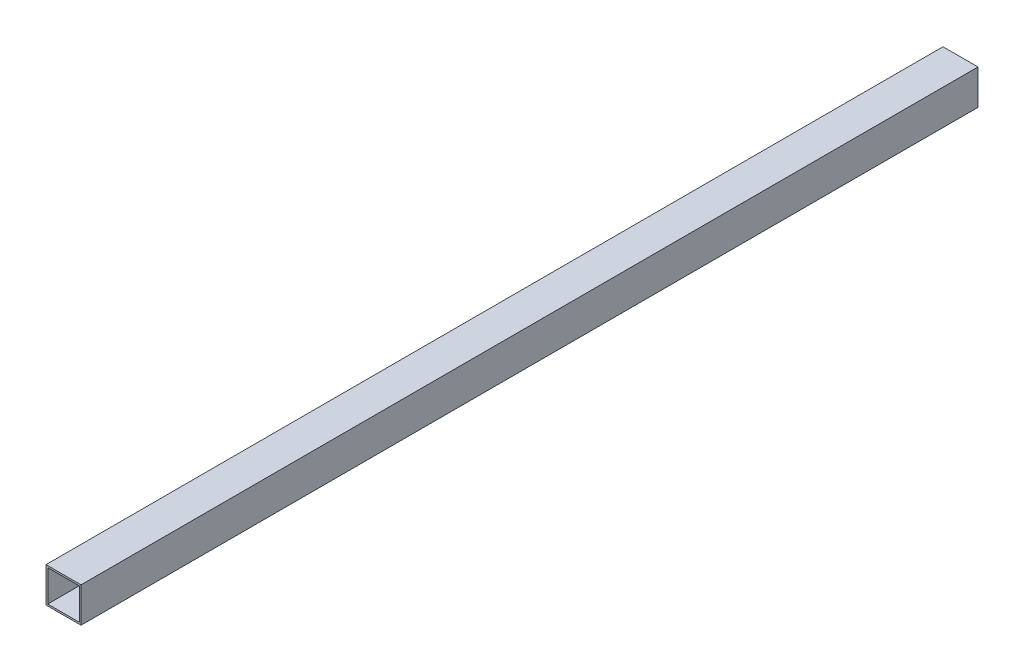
ISO-10303-21;
HEADER;
FILE_DESCRIPTION(('STEP AP214'),'2;1');
FILE_NAME('part.step','',(''),(''),'','','');
FILE_SCHEMA(('AUTOMOTIVE_DESIGN { 1 0 10303 214 1 1 1 1 }'));
ENDSEC;
DATA;
#1=APPLICATION_CONTEXT('core data for automotive mechanical design processes');
#2=APPLICATION_PROTOCOL_DEFINITION('international standard','automotive_design',2000,#1);
#3=PRODUCT_CONTEXT('',#1,'mechanical');
#4=PRODUCT('Part','Part','',(#3));
#5=PRODUCT_RELATED_PRODUCT_CATEGORY('part','',(#4));
#6=PRODUCT_DEFINITION_FORMATION('','',#4);
#7=PRODUCT_DEFINITION_CONTEXT('part definition',#1,'design');
#8=PRODUCT_DEFINITION('design','',#6,#7);
#9=PRODUCT_DEFINITION_SHAPE('','',#8);
#10=(LENGTH_UNIT() NAMED_UNIT(*) SI_UNIT(.MILLI.,.METRE.));
#11=(NAMED_UNIT(*) PLANE_ANGLE_UNIT() SI_UNIT($,.RADIAN.));
#12=(NAMED_UNIT(*) SI_UNIT($,.STERADIAN.) SOLID_ANGLE_UNIT());
#13=UNCERTAINTY_MEASURE_WITH_UNIT(LENGTH_MEASURE(1.E-05),#10,'distance_accuracy_value','');
#14=(GEOMETRIC_REPRESENTATION_CONTEXT(3) GLOBAL_UNCERTAINTY_ASSIGNED_CONTEXT((#13)) GLOBAL_UNIT_ASSIGNED_CONTEXT((#10,
#11,#12)) REPRESENTATION_CONTEXT('',''));
#15=CARTESIAN_POINT('',(0.,0.,0.));
#16=DIRECTION('',(0.,0.,1.));
#17=DIRECTION('',(1.,0.,0.));
#18=AXIS2_PLACEMENT_3D('',#15,#16,#17);
#19=CARTESIAN_POINT('',(0.,0.,2050.));
#20=DIRECTION('',(0.,0.,1.));
#21=DIRECTION('',(1.,0.,0.));
#22=AXIS2_PLACEMENT_3D('',#19,#20,#21);
#23=PLANE('',#22);
#24=DIRECTION('',(0.,-1.,0.));
#25=VECTOR('',#24,1.);
#26=CARTESIAN_POINT('',(-36.,36.,2050.));
#27=LINE('',#26,#25);
#28=CARTESIAN_POINT('',(-36.,36.,2050.));
#29=VERTEX_POINT('',#28);
#30=CARTESIAN_POINT('',(-36.,-36.,2050.));
#31=VERTEX_POINT('',#30);
#32=EDGE_CURVE('E27',#29,#31,#27,.T.);
#33=ORIENTED_EDGE('',*,*,#32,.F.);
#34=DIRECTION('',(-1.,0.,0.));
#35=VECTOR('',#34,1.);
#36=CARTESIAN_POINT('',(36.,36.,2050.));
#37=LINE('',#36,#35);
#38=CARTESIAN_POINT('',(36.,36.,2050.));
#39=VERTEX_POINT('',#38);
#40=EDGE_CURVE('E183',#39,#29,#37,.T.);
#41=ORIENTED_EDGE('',*,*,#40,.F.);
#42=DIRECTION('',(0.,1.,0.));
#43=VECTOR('',#42,1.);
#44=CARTESIAN_POINT('',(36.,-36.,2050.));
#45=LINE('',#44,#43);
#46=CARTESIAN_POINT('',(36.,-36.,2050.));
#47=VERTEX_POINT('',#46);
#48=EDGE_CURVE('E171',#47,#39,#45,.T.);
#49=ORIENTED_EDGE('',*,*,#48,.F.);
#50=DIRECTION('',(1.,0.,0.));
#51=VECTOR('',#50,1.);
#52=CARTESIAN_POINT('',(-36.,-36.,2050.));
#53=LINE('',#52,#51);
#54=EDGE_CURVE('E163',#31,#47,#53,.T.);
#55=ORIENTED_EDGE('',*,*,#54,.F.);
#56=EDGE_LOOP('',(#33,#41,#49,#55));
#57=FACE_BOUND('',#56,.T.);
#58=DIRECTION('',(1.,0.,0.));
#59=VECTOR('',#58,1.);
#60=CARTESIAN_POINT('',(-40.,-40.,2050.));
#61=LINE('',#60,#59);
#62=CARTESIAN_POINT('',(-40.,-40.,2050.));
#63=VERTEX_POINT('',#62);
#64=CARTESIAN_POINT('',(40.,-40.,2050.));
#65=VERTEX_POINT('',#64);
#66=EDGE_CURVE('E118',#63,#65,#61,.T.);
#67=ORIENTED_EDGE('',*,*,#66,.T.);
#68=DIRECTION('',(0.,1.,0.));
#69=VECTOR('',#68,1.);
#70=CARTESIAN_POINT('',(40.,-40.,2050.));
#71=LINE('',#70,#69);
#72=CARTESIAN_POINT('',(40.,40.,2050.));
#73=VERTEX_POINT('',#72);
#74=EDGE_CURVE('E135',#65,#73,#71,.T.);
#75=ORIENTED_EDGE('',*,*,#74,.T.);
#76=DIRECTION('',(-1.,0.,0.));
#77=VECTOR('',#76,1.);
#78=CARTESIAN_POINT('',(40.,40.,2050.));
#79=LINE('',#78,#77);
#80=CARTESIAN_POINT('',(-40.,40.,2050.));
#81=VERTEX_POINT('',#80);
#82=EDGE_CURVE('E110',#73,#81,#79,.T.);
#83=ORIENTED_EDGE('',*,*,#82,.T.);
#84=DIRECTION('',(0.,-1.,0.));
#85=VECTOR('',#84,1.);
#86=CARTESIAN_POINT('',(-40.,40.,2050.));
#87=LINE('',#86,#85);
#88=EDGE_CURVE('E109',#81,#63,#87,.T.);
#89=ORIENTED_EDGE('',*,*,#88,.T.);
#90=EDGE_LOOP('',(#67,#75,#83,#89));
#91=FACE_BOUND('',#90,.T.);
#92=ADVANCED_FACE('F16',(#57,#91),#23,.T.);
#93=CARTESIAN_POINT('',(0.,0.,0.));
#94=DIRECTION('',(0.,0.,1.));
#95=DIRECTION('',(1.,0.,0.));
#96=AXIS2_PLACEMENT_3D('',#93,#94,#95);
#97=PLANE('',#96);
#98=DIRECTION('',(1.,0.,0.));
#99=VECTOR('',#98,1.);
#100=CARTESIAN_POINT('',(-36.,-36.,0.));
#101=LINE('',#100,#99);
#102=CARTESIAN_POINT('',(-36.,-36.,0.));
#103=VERTEX_POINT('',#102);
#104=CARTESIAN_POINT('',(36.,-36.,0.));
#105=VERTEX_POINT('',#104);
#106=EDGE_CURVE('E134',#103,#105,#101,.T.);
#107=ORIENTED_EDGE('',*,*,#106,.T.);
#108=DIRECTION('',(0.,1.,0.));
#109=VECTOR('',#108,1.);
#110=CARTESIAN_POINT('',(36.,-36.,0.));
#111=LINE('',#110,#109);
#112=CARTESIAN_POINT('',(36.,36.,0.));
#113=VERTEX_POINT('',#112);
#114=EDGE_CURVE('E179',#105,#113,#111,.T.);
#115=ORIENTED_EDGE('',*,*,#114,.T.);
#116=DIRECTION('',(-1.,0.,0.));
#117=VECTOR('',#116,1.);
#118=CARTESIAN_POINT('',(36.,36.,0.));
#119=LINE('',#118,#117);
#120=CARTESIAN_POINT('',(-36.,36.,0.));
#121=VERTEX_POINT('',#120);
#122=EDGE_CURVE('E158',#113,#121,#119,.T.);
#123=ORIENTED_EDGE('',*,*,#122,.T.);
#124=DIRECTION('',(0.,-1.,0.));
#125=VECTOR('',#124,1.);
#126=CARTESIAN_POINT('',(-36.,36.,0.));
#127=LINE('',#126,#125);
#128=EDGE_CURVE('E10',#121,#103,#127,.T.);
#129=ORIENTED_EDGE('',*,*,#128,.T.);
#130=EDGE_LOOP('',(#107,#115,#123,#129));
#131=FACE_BOUND('',#130,.T.);
#132=DIRECTION('',(0.,-1.,0.));
#133=VECTOR('',#132,1.);
#134=CARTESIAN_POINT('',(-40.,40.,0.));
#135=LINE('',#134,#133);
#136=CARTESIAN_POINT('',(-40.,40.,0.));
#137=VERTEX_POINT('',#136);
#138=CARTESIAN_POINT('',(-40.,-40.,0.));
#139=VERTEX_POINT('',#138);
#140=EDGE_CURVE('E98',#137,#139,#135,.T.);
#141=ORIENTED_EDGE('',*,*,#140,.F.);
#142=DIRECTION('',(-1.,0.,0.));
#143=VECTOR('',#142,1.);
#144=CARTESIAN_POINT('',(40.,40.,0.));
#145=LINE('',#144,#143);
#146=CARTESIAN_POINT('',(40.,40.,0.));
#147=VERTEX_POINT('',#146);
#148=EDGE_CURVE('E137',#147,#137,#145,.T.);
#149=ORIENTED_EDGE('',*,*,#148,.F.);
#150=DIRECTION('',(0.,1.,0.));
#151=VECTOR('',#150,1.);
#152=CARTESIAN_POINT('',(40.,-40.,0.));
#153=LINE('',#152,#151);
#154=CARTESIAN_POINT('',(40.,-40.,0.));
#155=VERTEX_POINT('',#154);
#156=EDGE_CURVE('E120',#155,#147,#153,.T.);
#157=ORIENTED_EDGE('',*,*,#156,.F.);
#158=DIRECTION('',(1.,0.,0.));
#159=VECTOR('',#158,1.);
#160=CARTESIAN_POINT('',(-40.,-40.,0.));
#161=LINE('',#160,#159);
#162=EDGE_CURVE('E116',#139,#155,#161,.T.);
#163=ORIENTED_EDGE('',*,*,#162,.F.);
#164=EDGE_LOOP('',(#141,#149,#157,#163));
#165=FACE_BOUND('',#164,.T.);
#166=ADVANCED_FACE('F18',(#131,#165),#97,.F.);
#167=CARTESIAN_POINT('',(-36.,36.,0.));
#168=DIRECTION('',(1.,0.,0.));
#169=DIRECTION('',(0.,1.,0.));
#170=AXIS2_PLACEMENT_3D('',#167,#168,#169);
#171=PLANE('',#170);
#172=DIRECTION('',(0.,0.,1.));
#173=VECTOR('',#172,1.);
#174=CARTESIAN_POINT('',(-36.,36.,0.));
#175=LINE('',#174,#173);
#176=EDGE_CURVE('E20',#121,#29,#175,.T.);
#177=ORIENTED_EDGE('',*,*,#176,.T.);
#178=ORIENTED_EDGE('',*,*,#32,.T.);
#179=DIRECTION('',(0.,0.,1.));
#180=VECTOR('',#179,1.);
#181=CARTESIAN_POINT('',(-36.,-36.,0.));
#182=LINE('',#181,#180);
#183=EDGE_CURVE('E156',#103,#31,#182,.T.);
#184=ORIENTED_EDGE('',*,*,#183,.F.);
#185=ORIENTED_EDGE('',*,*,#128,.F.);
#186=EDGE_LOOP('',(#177,#178,#184,#185));
#187=FACE_BOUND('',#186,.T.);
#188=ADVANCED_FACE('F193',(#187),#171,.T.);
#189=CARTESIAN_POINT('',(36.,36.,0.));
#190=DIRECTION('',(0.,-1.,0.));
#191=DIRECTION('',(0.,0.,-1.));
#192=AXIS2_PLACEMENT_3D('',#189,#190,#191);
#193=PLANE('',#192);
#194=DIRECTION('',(0.,0.,1.));
#195=VECTOR('',#194,1.);
#196=CARTESIAN_POINT('',(36.,36.,0.));
#197=LINE('',#196,#195);
#198=EDGE_CURVE('E175',#113,#39,#197,.T.);
#199=ORIENTED_EDGE('',*,*,#198,.T.);
#200=ORIENTED_EDGE('',*,*,#40,.T.);
#201=ORIENTED_EDGE('',*,*,#176,.F.);
#202=ORIENTED_EDGE('',*,*,#122,.F.);
#203=EDGE_LOOP('',(#199,#200,#201,#202));
#204=FACE_BOUND('',#203,.T.);
#205=ADVANCED_FACE('F196',(#204),#193,.T.);
#206=CARTESIAN_POINT('',(36.,-36.,0.));
#207=DIRECTION('',(-1.,0.,0.));
#208=DIRECTION('',(0.,0.,1.));
#209=AXIS2_PLACEMENT_3D('',#206,#207,#208);
#210=PLANE('',#209);
#211=DIRECTION('',(0.,0.,1.));
#212=VECTOR('',#211,1.);
#213=CARTESIAN_POINT('',(36.,-36.,0.));
#214=LINE('',#213,#212);
#215=EDGE_CURVE('E167',#105,#47,#214,.T.);
#216=ORIENTED_EDGE('',*,*,#215,.T.);
#217=ORIENTED_EDGE('',*,*,#48,.T.);
#218=ORIENTED_EDGE('',*,*,#198,.F.);
#219=ORIENTED_EDGE('',*,*,#114,.F.);
#220=EDGE_LOOP('',(#216,#217,#218,#219));
#221=FACE_BOUND('',#220,.T.);
#222=ADVANCED_FACE('F212',(#221),#210,.T.);
#223=CARTESIAN_POINT('',(-36.,-36.,0.));
#224=DIRECTION('',(0.,1.,0.));
#225=DIRECTION('',(1.,0.,0.));
#226=AXIS2_PLACEMENT_3D('',#223,#224,#225);
#227=PLANE('',#226);
#228=ORIENTED_EDGE('',*,*,#183,.T.);
#229=ORIENTED_EDGE('',*,*,#54,.T.);
#230=ORIENTED_EDGE('',*,*,#215,.F.);
#231=ORIENTED_EDGE('',*,*,#106,.F.);
#232=EDGE_LOOP('',(#228,#229,#230,#231));
#233=FACE_BOUND('',#232,.T.);
#234=ADVANCED_FACE('F203',(#233),#227,.T.);
#235=CARTESIAN_POINT('',(-40.,40.,0.));
#236=DIRECTION('',(1.,0.,0.));
#237=DIRECTION('',(0.,1.,0.));
#238=AXIS2_PLACEMENT_3D('',#235,#236,#237);
#239=PLANE('',#238);
#240=ORIENTED_EDGE('',*,*,#140,.T.);
#241=DIRECTION('',(0.,0.,1.));
#242=VECTOR('',#241,1.);
#243=CARTESIAN_POINT('',(-40.,-40.,0.));
#244=LINE('',#243,#242);
#245=EDGE_CURVE('E101',#139,#63,#244,.T.);
#246=ORIENTED_EDGE('',*,*,#245,.T.);
#247=ORIENTED_EDGE('',*,*,#88,.F.);
#248=DIRECTION('',(0.,0.,1.));
#249=VECTOR('',#248,1.);
#250=CARTESIAN_POINT('',(-40.,40.,0.));
#251=LINE('',#250,#249);
#252=EDGE_CURVE('E104',#137,#81,#251,.T.);
#253=ORIENTED_EDGE('',*,*,#252,.F.);
#254=EDGE_LOOP('',(#240,#246,#247,#253));
#255=FACE_BOUND('',#254,.T.);
#256=ADVANCED_FACE('F100',(#255),#239,.F.);
#257=CARTESIAN_POINT('',(40.,40.,0.));
#258=DIRECTION('',(0.,-1.,0.));
#259=DIRECTION('',(0.,0.,-1.));
#260=AXIS2_PLACEMENT_3D('',#257,#258,#259);
#261=PLANE('',#260);
#262=ORIENTED_EDGE('',*,*,#148,.T.);
#263=ORIENTED_EDGE('',*,*,#252,.T.);
#264=ORIENTED_EDGE('',*,*,#82,.F.);
#265=DIRECTION('',(0.,0.,1.));
#266=VECTOR('',#265,1.);
#267=CARTESIAN_POINT('',(40.,40.,0.));
#268=LINE('',#267,#266);
#269=EDGE_CURVE('E138',#147,#73,#268,.T.);
#270=ORIENTED_EDGE('',*,*,#269,.F.);
#271=EDGE_LOOP('',(#262,#263,#264,#270));
#272=FACE_BOUND('',#271,.T.);
#273=ADVANCED_FACE('F230',(#272),#261,.F.);
#274=CARTESIAN_POINT('',(40.,-40.,0.));
#275=DIRECTION('',(-1.,0.,0.));
#276=DIRECTION('',(0.,0.,1.));
#277=AXIS2_PLACEMENT_3D('',#274,#275,#276);
#278=PLANE('',#277);
#279=ORIENTED_EDGE('',*,*,#156,.T.);
#280=ORIENTED_EDGE('',*,*,#269,.T.);
#281=ORIENTED_EDGE('',*,*,#74,.F.);
#282=DIRECTION('',(0.,0.,1.));
#283=VECTOR('',#282,1.);
#284=CARTESIAN_POINT('',(40.,-40.,0.));
#285=LINE('',#284,#283);
#286=EDGE_CURVE('E125',#155,#65,#285,.T.);
#287=ORIENTED_EDGE('',*,*,#286,.F.);
#288=EDGE_LOOP('',(#279,#280,#281,#287));
#289=FACE_BOUND('',#288,.T.);
#290=ADVANCED_FACE('F228',(#289),#278,.F.);
#291=CARTESIAN_POINT('',(-40.,-40.,0.));
#292=DIRECTION('',(0.,1.,0.));
#293=DIRECTION('',(1.,0.,0.));
#294=AXIS2_PLACEMENT_3D('',#291,#292,#293);
#295=PLANE('',#294);
#296=ORIENTED_EDGE('',*,*,#162,.T.);
#297=ORIENTED_EDGE('',*,*,#286,.T.);
#298=ORIENTED_EDGE('',*,*,#66,.F.);
#299=ORIENTED_EDGE('',*,*,#245,.F.);
#300=EDGE_LOOP('',(#296,#297,#298,#299));
#301=FACE_BOUND('',#300,.T.);
#302=ADVANCED_FACE('F114',(#301),#295,.F.);
#303=CLOSED_SHELL('',(#92,#166,#188,#205,#222,#234,#256,#273,#290,#302));
#304=MANIFOLD_SOLID_BREP('B1',#303);
#305=ADVANCED_BREP_SHAPE_REPRESENTATION('',(#18,#304),#14);
#306=SHAPE_DEFINITION_REPRESENTATION(#9,#305);
ENDSEC;
END-ISO-10303-21;
